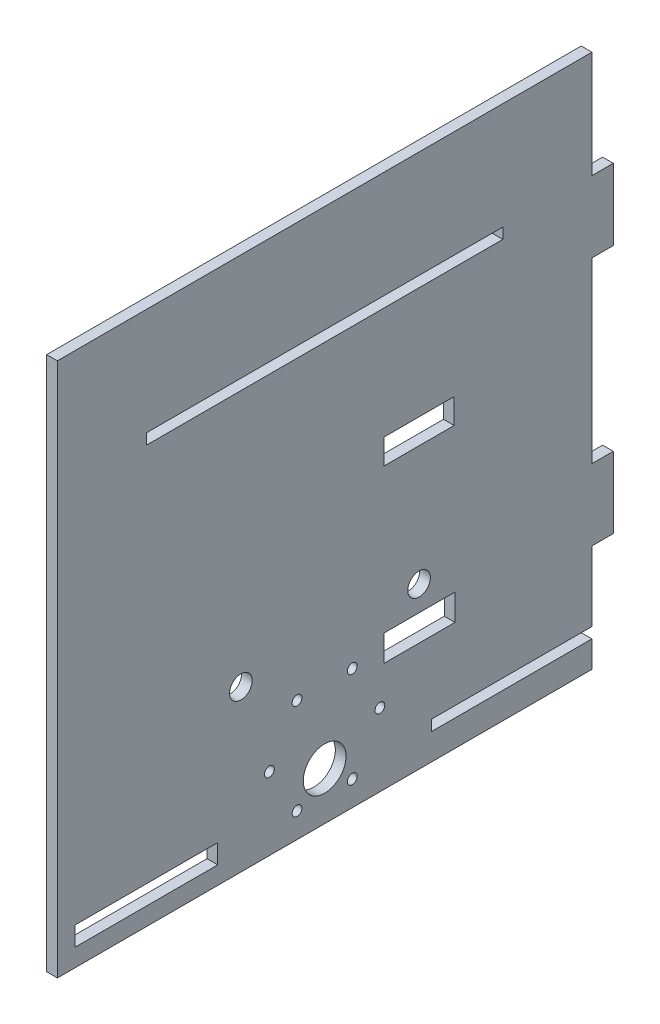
from build123d import *

# Parameters (mm, degrees)
SKETCH1_W                      = 150
SKETCH1_H                      = 150
BOSS_EXTRUDE1_DEPTH            = 3
SKETCH2_W                      = 6
SKETCH2_H                      = 20
MOUNT_TO_BACK_DEPTH            = 3
SKETCH4_R                      = 3.175
SKETCH4_R_2                    = 1.372704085
SKETCH4_R_3                    = 6
SKETCH4_W                      = 40
SKETCH4_H                      = 5.404958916
SKETCH4_W_2                    = 100
SKETCH4_H_2                    = 3
SKETCH4_W_3                    = 45
MOTOR_LINKAGE_BOTTOM_CUT_DEPTH = 111.430973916
SKETCH6_W                      = 19.9136
SKETCH6_H                      = 7.365352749
SERVOBOTTOMSLOT_DEPTH          = 10
SKETCH7_W                      = 19.685
SKETCH7_H                      = 7.020222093
SERVOTOPSLOT_DEPTH             = 10


with BuildPart() as part:
    # Sketch1 → Boss-Extrude1 (new body)
    with BuildSketch(Plane(origin=(0, 0, 0), x_dir=(0, 0, -1), z_dir=(1, 0, 0))):
        Rectangle(SKETCH1_W, SKETCH1_H)
    extrude(amount=BOSS_EXTRUDE1_DEPTH)

    # Sketch2 → mount to back (add)
    with BuildSketch(Plane(origin=(3, 0, 0), x_dir=(0, 0, -1), z_dir=(1, 0, 0))):
        with Locations((78, 35)):
            Rectangle(SKETCH2_W, SKETCH2_H)
        with Locations((78, -35)):
            Rectangle(SKETCH2_W, SKETCH2_H)
    extrude(amount=-MOUNT_TO_BACK_DEPTH)

    # Sketch4 → motor linkage bottom cut (cut, through all)
    with BuildSketch(Plane.ZY):
        with Locations((-26.5, -30)):
            Circle(SKETCH4_R)
        with Locations((23.5, -30)):
            Circle(SKETCH4_R)
        with Locations((7.75, -41.171634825)):
            Circle(SKETCH4_R_2)
        with Locations((15.5, -54.595028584)):
            Circle(SKETCH4_R_2)
        with Locations((7.75, -68.018422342)):
            Circle(SKETCH4_R_2)
        with Locations((-7.75, -68.018422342)):
            Circle(SKETCH4_R_2)
        with Locations((-15.5, -54.595028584)):
            Circle(SKETCH4_R_2)
        with Locations((-7.75, -41.171634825)):
            Circle(SKETCH4_R_2)
        with Locations((0, -61.595041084)):
            Circle(SKETCH4_R_3)
        with Locations((50, -67.297520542)):
            Rectangle(SKETCH4_W, SKETCH4_H)
        with Locations((0, 43.49995)):
            Rectangle(SKETCH4_W_2, SKETCH4_H_2)
        with Locations((-52.5, -66.095028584)):
            Rectangle(SKETCH4_W_3, SKETCH4_H_2)
    extrude(amount=-MOTOR_LINKAGE_BOTTOM_CUT_DEPTH, mode=Mode.SUBTRACT)

    # Sketch6 → servobottomslot (cut)
    with BuildSketch(Plane(origin=(3, 0, 0), x_dir=(0, 0, -1), z_dir=(1, 0, 0))):
        with Locations((26.6143, -40.677982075)):
            Rectangle(SKETCH6_W, SKETCH6_H)
    extrude(amount=-SERVOBOTTOMSLOT_DEPTH, mode=Mode.SUBTRACT)

    # Sketch7 → servotopslot (cut)
    with BuildSketch(Plane(origin=(3, 0, 0), x_dir=(0, 0, -1), z_dir=(1, 0, 0))):
        with Locations((26.5, 7.11539844)):
            Rectangle(SKETCH7_W, SKETCH7_H)
    extrude(amount=-SERVOTOPSLOT_DEPTH, mode=Mode.SUBTRACT)


solid = part.part
